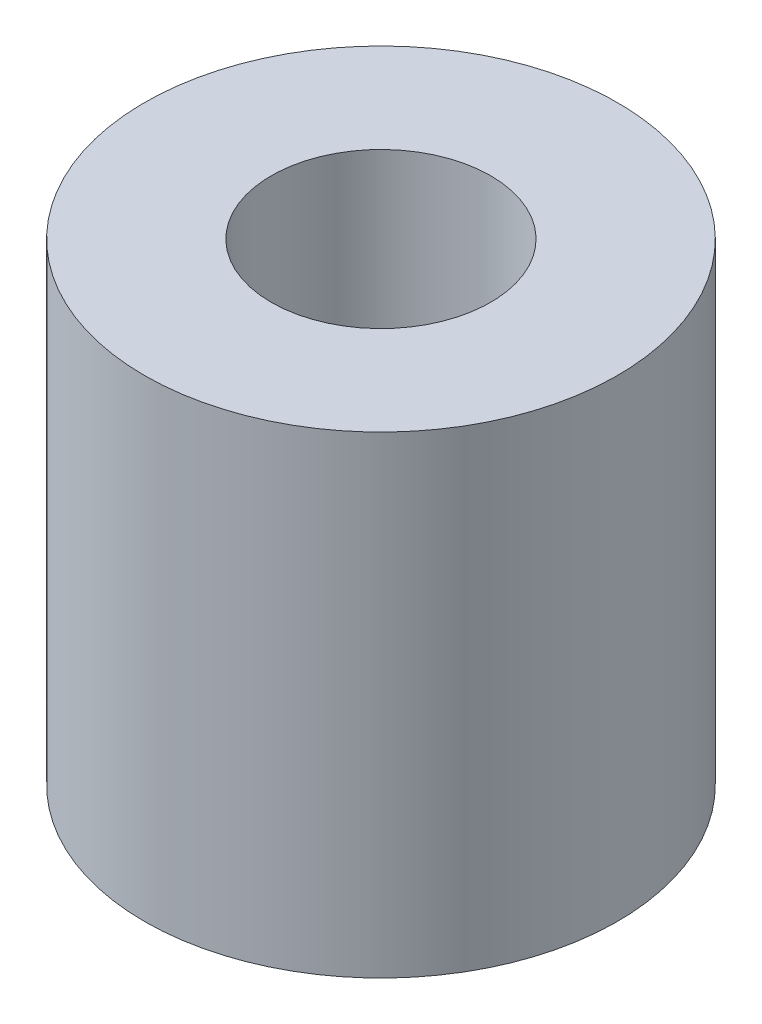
from build123d import *

# Parameters (mm, degrees)
SKETCH1_R      = 3.175
SKETCH1_R_2    = 1.4732
EXTRUDE1_DEPTH = 6.35


with BuildPart() as part:
    # Sketch1 → Extrude1 (new body)
    with BuildSketch(Plane(origin=(0, 0, 0), x_dir=(1, 0, 0), z_dir=(0, 1, 0))):
        with Locations(Location((0, 0, 0), (0, 0, 270))):
            Circle(SKETCH1_R)
        with Locations(Location((0, 0, 0), (0, 0, 270))):
            Circle(SKETCH1_R_2, mode=Mode.SUBTRACT)
    extrude(amount=EXTRUDE1_DEPTH)


solid = part.part
